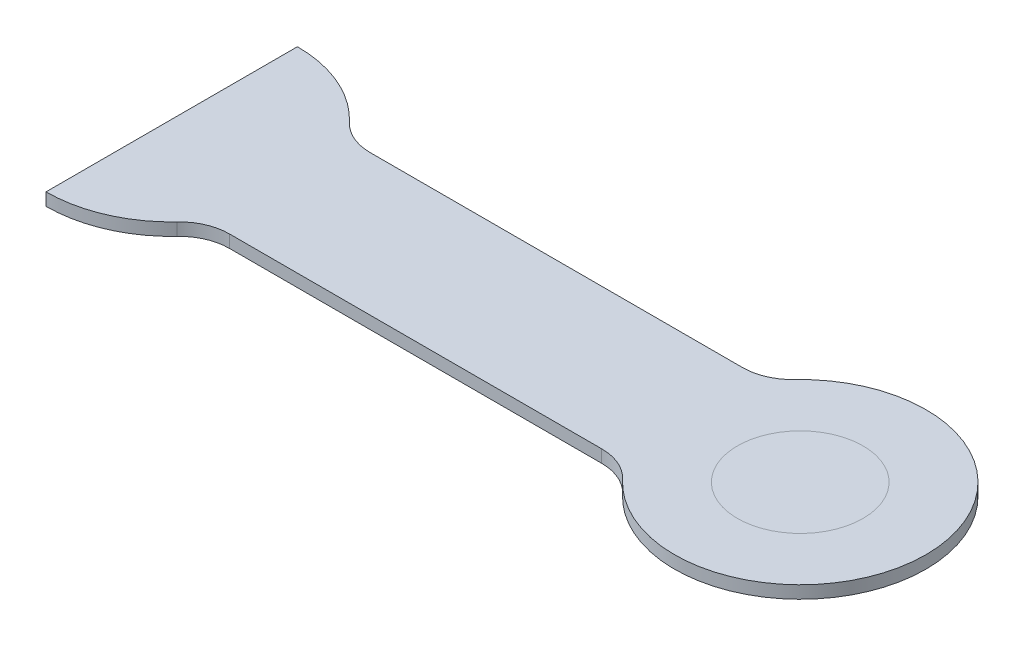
ISO-10303-21;
HEADER;
FILE_DESCRIPTION(('STEP AP214'),'2;1');
FILE_NAME('part.step','',(''),(''),'','','');
FILE_SCHEMA(('AUTOMOTIVE_DESIGN { 1 0 10303 214 1 1 1 1 }'));
ENDSEC;
DATA;
#1=APPLICATION_CONTEXT('core data for automotive mechanical design processes');
#2=APPLICATION_PROTOCOL_DEFINITION('international standard','automotive_design',2000,#1);
#3=PRODUCT_CONTEXT('',#1,'mechanical');
#4=PRODUCT('Part','Part','',(#3));
#5=PRODUCT_RELATED_PRODUCT_CATEGORY('part','',(#4));
#6=PRODUCT_DEFINITION_FORMATION('','',#4);
#7=PRODUCT_DEFINITION_CONTEXT('part definition',#1,'design');
#8=PRODUCT_DEFINITION('design','',#6,#7);
#9=PRODUCT_DEFINITION_SHAPE('','',#8);
#10=(LENGTH_UNIT() NAMED_UNIT(*) SI_UNIT(.MILLI.,.METRE.));
#11=(NAMED_UNIT(*) PLANE_ANGLE_UNIT() SI_UNIT($,.RADIAN.));
#12=(NAMED_UNIT(*) SI_UNIT($,.STERADIAN.) SOLID_ANGLE_UNIT());
#13=UNCERTAINTY_MEASURE_WITH_UNIT(LENGTH_MEASURE(1.E-05),#10,'distance_accuracy_value','');
#14=(GEOMETRIC_REPRESENTATION_CONTEXT(3) GLOBAL_UNCERTAINTY_ASSIGNED_CONTEXT((#13)) GLOBAL_UNIT_ASSIGNED_CONTEXT((#10,
#11,#12)) REPRESENTATION_CONTEXT('',''));
#15=CARTESIAN_POINT('',(0.,0.,0.));
#16=DIRECTION('',(0.,0.,1.));
#17=DIRECTION('',(1.,0.,0.));
#18=AXIS2_PLACEMENT_3D('',#15,#16,#17);
#19=CARTESIAN_POINT('',(0.,5.,50.));
#20=DIRECTION('',(0.,-1.,0.));
#21=DIRECTION('',(1.,0.,0.));
#22=AXIS2_PLACEMENT_3D('',#19,#20,#21);
#23=PLANE('',#22);
#24=DIRECTION('',(0.,0.,-1.));
#25=VECTOR('',#24,1.);
#26=CARTESIAN_POINT('',(-300.,4.99999999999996,50.));
#27=LINE('',#26,#25);
#28=CARTESIAN_POINT('',(-300.,4.99999999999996,50.));
#29=VERTEX_POINT('',#28);
#30=CARTESIAN_POINT('',(-300.,4.99999999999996,-50.));
#31=VERTEX_POINT('',#30);
#32=EDGE_CURVE('E115',#29,#31,#27,.T.);
#33=ORIENTED_EDGE('',*,*,#32,.F.);
#34=CARTESIAN_POINT('',(-300.,4.99999999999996,0.));
#35=DIRECTION('',(0.,1.,0.));
#36=DIRECTION('',(-1.,0.,0.));
#37=AXIS2_PLACEMENT_3D('',#34,#35,#36);
#38=CIRCLE('',#37,50.);
#39=CARTESIAN_POINT('',(-263.606459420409,4.99999999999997,34.2857142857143));
#40=VERTEX_POINT('',#39);
#41=EDGE_CURVE('E197',#29,#40,#38,.T.);
#42=ORIENTED_EDGE('',*,*,#41,.T.);
#43=CARTESIAN_POINT('',(-249.049043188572,4.99999999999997,48.));
#44=DIRECTION('',(0.,-1.,0.));
#45=DIRECTION('',(1.,0.,0.));
#46=AXIS2_PLACEMENT_3D('',#43,#44,#45);
#47=CIRCLE('',#46,20.);
#48=CARTESIAN_POINT('',(-249.049043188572,4.99999999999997,28.));
#49=VERTEX_POINT('',#48);
#50=EDGE_CURVE('E177',#40,#49,#47,.T.);
#51=ORIENTED_EDGE('',*,*,#50,.T.);
#52=DIRECTION('',(1.,0.,0.));
#53=VECTOR('',#52,1.);
#54=CARTESIAN_POINT('',(-91.424630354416,4.99999999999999,28.));
#55=LINE('',#54,#53);
#56=CARTESIAN_POINT('',(-100.950956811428,4.99999999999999,28.));
#57=VERTEX_POINT('',#56);
#58=EDGE_CURVE('E200',#49,#57,#55,.T.);
#59=ORIENTED_EDGE('',*,*,#58,.T.);
#60=CARTESIAN_POINT('',(-100.950956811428,4.99999999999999,48.));
#61=DIRECTION('',(0.,-1.,0.));
#62=DIRECTION('',(1.,0.,0.));
#63=AXIS2_PLACEMENT_3D('',#60,#61,#62);
#64=CIRCLE('',#63,20.);
#65=CARTESIAN_POINT('',(-86.3935405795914,4.99999999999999,34.2857142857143));
#66=VERTEX_POINT('',#65);
#67=EDGE_CURVE('E180',#57,#66,#64,.T.);
#68=ORIENTED_EDGE('',*,*,#67,.T.);
#69=CARTESIAN_POINT('',(-50.,4.99999999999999,0.));
#70=DIRECTION('',(0.,1.,0.));
#71=DIRECTION('',(-1.,0.,0.));
#72=AXIS2_PLACEMENT_3D('',#69,#70,#71);
#73=CIRCLE('',#72,50.);
#74=CARTESIAN_POINT('',(-86.3935405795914,4.99999999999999,-34.2857142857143));
#75=VERTEX_POINT('',#74);
#76=EDGE_CURVE('E186',#66,#75,#73,.T.);
#77=ORIENTED_EDGE('',*,*,#76,.T.);
#78=CARTESIAN_POINT('',(-100.950956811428,4.99999999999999,-48.));
#79=DIRECTION('',(0.,-1.,0.));
#80=DIRECTION('',(1.,0.,0.));
#81=AXIS2_PLACEMENT_3D('',#78,#79,#80);
#82=CIRCLE('',#81,20.);
#83=CARTESIAN_POINT('',(-100.950956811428,4.99999999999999,-28.));
#84=VERTEX_POINT('',#83);
#85=EDGE_CURVE('E41',#75,#84,#82,.T.);
#86=ORIENTED_EDGE('',*,*,#85,.T.);
#87=DIRECTION('',(-1.,0.,0.));
#88=VECTOR('',#87,1.);
#89=CARTESIAN_POINT('',(-91.424630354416,4.99999999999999,-28.));
#90=LINE('',#89,#88);
#91=CARTESIAN_POINT('',(-249.049043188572,4.99999999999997,-28.));
#92=VERTEX_POINT('',#91);
#93=EDGE_CURVE('E124',#84,#92,#90,.T.);
#94=ORIENTED_EDGE('',*,*,#93,.T.);
#95=CARTESIAN_POINT('',(-249.049043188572,4.99999999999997,-48.));
#96=DIRECTION('',(0.,-1.,0.));
#97=DIRECTION('',(1.,0.,0.));
#98=AXIS2_PLACEMENT_3D('',#95,#96,#97);
#99=CIRCLE('',#98,20.);
#100=CARTESIAN_POINT('',(-263.606459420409,4.99999999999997,-34.2857142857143));
#101=VERTEX_POINT('',#100);
#102=EDGE_CURVE('E119',#92,#101,#99,.T.);
#103=ORIENTED_EDGE('',*,*,#102,.T.);
#104=CARTESIAN_POINT('',(-300.,4.99999999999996,0.));
#105=DIRECTION('',(0.,1.,0.));
#106=DIRECTION('',(-1.,0.,0.));
#107=AXIS2_PLACEMENT_3D('',#104,#105,#106);
#108=CIRCLE('',#107,50.);
#109=EDGE_CURVE('E111',#101,#31,#108,.T.);
#110=ORIENTED_EDGE('',*,*,#109,.T.);
#111=EDGE_LOOP('',(#33,#42,#51,#59,#68,#77,#86,#94,#103,#110));
#112=FACE_BOUND('',#111,.T.);
#113=CARTESIAN_POINT('',(-50.,4.99999999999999,0.));
#114=DIRECTION('',(0.,-1.,0.));
#115=DIRECTION('',(1.,0.,0.));
#116=AXIS2_PLACEMENT_3D('',#113,#114,#115);
#117=CIRCLE('',#116,25.);
#118=CARTESIAN_POINT('',(-25.,5.,0.));
#119=VERTEX_POINT('',#118);
#120=EDGE_CURVE('E11',#119,#119,#117,.F.);
#121=ORIENTED_EDGE('',*,*,#120,.F.);
#122=EDGE_LOOP('',(#121));
#123=FACE_BOUND('',#122,.T.);
#124=ADVANCED_FACE('F32',(#112,#123),#23,.F.);
#125=CARTESIAN_POINT('',(-50.,4.99999999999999,0.));
#126=DIRECTION('',(0.,-1.,0.));
#127=DIRECTION('',(1.,0.,0.));
#128=AXIS2_PLACEMENT_3D('',#125,#126,#127);
#129=CYLINDRICAL_SURFACE('',#128,50.);
#130=ORIENTED_EDGE('',*,*,#76,.F.);
#131=DIRECTION('',(0.,-1.,0.));
#132=VECTOR('',#131,1.);
#133=CARTESIAN_POINT('',(-86.3935405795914,4.99999999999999,34.2857142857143));
#134=LINE('',#133,#132);
#135=CARTESIAN_POINT('',(-86.3935405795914,0.,34.2857142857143));
#136=VERTEX_POINT('',#135);
#137=EDGE_CURVE('E170',#66,#136,#134,.T.);
#138=ORIENTED_EDGE('',*,*,#137,.T.);
#139=CARTESIAN_POINT('',(-50.,0.,0.));
#140=DIRECTION('',(0.,-1.,0.));
#141=DIRECTION('',(1.,0.,0.));
#142=AXIS2_PLACEMENT_3D('',#139,#140,#141);
#143=CIRCLE('',#142,50.);
#144=CARTESIAN_POINT('',(-86.3935405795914,0.,-34.2857142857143));
#145=VERTEX_POINT('',#144);
#146=EDGE_CURVE('E145',#136,#145,#143,.F.);
#147=ORIENTED_EDGE('',*,*,#146,.T.);
#148=DIRECTION('',(0.,-1.,0.));
#149=VECTOR('',#148,1.);
#150=CARTESIAN_POINT('',(-86.3935405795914,4.99999999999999,-34.2857142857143));
#151=LINE('',#150,#149);
#152=EDGE_CURVE('E168',#145,#75,#151,.F.);
#153=ORIENTED_EDGE('',*,*,#152,.T.);
#154=EDGE_LOOP('',(#130,#138,#147,#153));
#155=FACE_BOUND('',#154,.T.);
#156=ADVANCED_FACE('F195',(#155),#129,.T.);
#157=CARTESIAN_POINT('',(-300.,4.99999999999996,0.));
#158=DIRECTION('',(0.,-1.,0.));
#159=DIRECTION('',(1.,0.,0.));
#160=AXIS2_PLACEMENT_3D('',#157,#158,#159);
#161=CYLINDRICAL_SURFACE('',#160,50.);
#162=CARTESIAN_POINT('',(-300.,0.,0.));
#163=DIRECTION('',(0.,-1.,0.));
#164=DIRECTION('',(1.,0.,0.));
#165=AXIS2_PLACEMENT_3D('',#162,#163,#164);
#166=CIRCLE('',#165,50.);
#167=CARTESIAN_POINT('',(-300.,0.,50.));
#168=VERTEX_POINT('',#167);
#169=CARTESIAN_POINT('',(-263.606459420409,0.,34.2857142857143));
#170=VERTEX_POINT('',#169);
#171=EDGE_CURVE('E141',#168,#170,#166,.F.);
#172=ORIENTED_EDGE('',*,*,#171,.T.);
#173=DIRECTION('',(0.,-1.,0.));
#174=VECTOR('',#173,1.);
#175=CARTESIAN_POINT('',(-263.606459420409,4.99999999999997,34.2857142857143));
#176=LINE('',#175,#174);
#177=EDGE_CURVE('E166',#170,#40,#176,.F.);
#178=ORIENTED_EDGE('',*,*,#177,.T.);
#179=ORIENTED_EDGE('',*,*,#41,.F.);
#180=DIRECTION('',(0.,1.,0.));
#181=VECTOR('',#180,1.);
#182=CARTESIAN_POINT('',(-300.,0.,50.));
#183=LINE('',#182,#181);
#184=EDGE_CURVE('E132',#168,#29,#183,.T.);
#185=ORIENTED_EDGE('',*,*,#184,.F.);
#186=EDGE_LOOP('',(#172,#178,#179,#185));
#187=FACE_BOUND('',#186,.T.);
#188=ADVANCED_FACE('F215',(#187),#161,.T.);
#189=CARTESIAN_POINT('',(-91.424630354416,4.99999999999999,28.));
#190=DIRECTION('',(0.,0.,-1.));
#191=DIRECTION('',(-1.,0.,0.));
#192=AXIS2_PLACEMENT_3D('',#189,#190,#191);
#193=PLANE('',#192);
#194=ORIENTED_EDGE('',*,*,#58,.F.);
#195=DIRECTION('',(0.,1.,0.));
#196=VECTOR('',#195,1.);
#197=CARTESIAN_POINT('',(-249.049043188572,0.,28.));
#198=LINE('',#197,#196);
#199=CARTESIAN_POINT('',(-249.049043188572,0.,28.));
#200=VERTEX_POINT('',#199);
#201=EDGE_CURVE('E163',#49,#200,#198,.F.);
#202=ORIENTED_EDGE('',*,*,#201,.T.);
#203=DIRECTION('',(1.,0.,0.));
#204=VECTOR('',#203,1.);
#205=CARTESIAN_POINT('',(0.,0.,28.));
#206=LINE('',#205,#204);
#207=CARTESIAN_POINT('',(-100.950956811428,0.,28.));
#208=VERTEX_POINT('',#207);
#209=EDGE_CURVE('E151',#200,#208,#206,.T.);
#210=ORIENTED_EDGE('',*,*,#209,.T.);
#211=DIRECTION('',(0.,1.,0.));
#212=VECTOR('',#211,1.);
#213=CARTESIAN_POINT('',(-100.950956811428,4.99999999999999,28.));
#214=LINE('',#213,#212);
#215=EDGE_CURVE('E161',#208,#57,#214,.T.);
#216=ORIENTED_EDGE('',*,*,#215,.T.);
#217=EDGE_LOOP('',(#194,#202,#210,#216));
#218=FACE_BOUND('',#217,.T.);
#219=ADVANCED_FACE('F213',(#218),#193,.F.);
#220=CARTESIAN_POINT('',(-91.424630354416,4.99999999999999,-28.));
#221=DIRECTION('',(0.,0.,1.));
#222=DIRECTION('',(1.,0.,0.));
#223=AXIS2_PLACEMENT_3D('',#220,#221,#222);
#224=PLANE('',#223);
#225=DIRECTION('',(-1.,0.,0.));
#226=VECTOR('',#225,1.);
#227=CARTESIAN_POINT('',(0.,0.,-28.));
#228=LINE('',#227,#226);
#229=CARTESIAN_POINT('',(-100.950956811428,0.,-28.));
#230=VERTEX_POINT('',#229);
#231=CARTESIAN_POINT('',(-249.049043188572,0.,-28.));
#232=VERTEX_POINT('',#231);
#233=EDGE_CURVE('E134',#230,#232,#228,.T.);
#234=ORIENTED_EDGE('',*,*,#233,.T.);
#235=DIRECTION('',(0.,1.,0.));
#236=VECTOR('',#235,1.);
#237=CARTESIAN_POINT('',(-249.049043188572,4.99999999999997,-28.));
#238=LINE('',#237,#236);
#239=EDGE_CURVE('E159',#232,#92,#238,.T.);
#240=ORIENTED_EDGE('',*,*,#239,.T.);
#241=ORIENTED_EDGE('',*,*,#93,.F.);
#242=DIRECTION('',(0.,1.,0.));
#243=VECTOR('',#242,1.);
#244=CARTESIAN_POINT('',(-100.950956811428,0.,-28.));
#245=LINE('',#244,#243);
#246=EDGE_CURVE('E156',#84,#230,#245,.F.);
#247=ORIENTED_EDGE('',*,*,#246,.T.);
#248=EDGE_LOOP('',(#234,#240,#241,#247));
#249=FACE_BOUND('',#248,.T.);
#250=ADVANCED_FACE('F191',(#249),#224,.F.);
#251=CARTESIAN_POINT('',(-300.,4.99999999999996,0.));
#252=DIRECTION('',(0.,-1.,0.));
#253=DIRECTION('',(1.,0.,0.));
#254=AXIS2_PLACEMENT_3D('',#251,#252,#253);
#255=CYLINDRICAL_SURFACE('',#254,50.);
#256=ORIENTED_EDGE('',*,*,#109,.F.);
#257=DIRECTION('',(0.,-1.,0.));
#258=VECTOR('',#257,1.);
#259=CARTESIAN_POINT('',(-263.606459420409,4.99999999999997,-34.2857142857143));
#260=LINE('',#259,#258);
#261=CARTESIAN_POINT('',(-263.606459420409,0.,-34.2857142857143));
#262=VERTEX_POINT('',#261);
#263=EDGE_CURVE('E154',#101,#262,#260,.T.);
#264=ORIENTED_EDGE('',*,*,#263,.T.);
#265=CARTESIAN_POINT('',(-300.,0.,0.));
#266=DIRECTION('',(0.,-1.,0.));
#267=DIRECTION('',(1.,0.,0.));
#268=AXIS2_PLACEMENT_3D('',#265,#266,#267);
#269=CIRCLE('',#268,50.);
#270=CARTESIAN_POINT('',(-300.,0.,-50.));
#271=VERTEX_POINT('',#270);
#272=EDGE_CURVE('E139',#262,#271,#269,.F.);
#273=ORIENTED_EDGE('',*,*,#272,.T.);
#274=DIRECTION('',(0.,1.,0.));
#275=VECTOR('',#274,1.);
#276=CARTESIAN_POINT('',(-300.,0.,-50.));
#277=LINE('',#276,#275);
#278=EDGE_CURVE('E130',#271,#31,#277,.T.);
#279=ORIENTED_EDGE('',*,*,#278,.T.);
#280=EDGE_LOOP('',(#256,#264,#273,#279));
#281=FACE_BOUND('',#280,.T.);
#282=ADVANCED_FACE('F137',(#281),#255,.T.);
#283=ORIENTED_EDGE('',*,*,#120,.T.);
#284=EDGE_LOOP('',(#283));
#285=FACE_BOUND('',#284,.T.);
#286=ADVANCED_FACE('F218',(#285),#23,.F.);
#287=CARTESIAN_POINT('',(-300.,0.,50.));
#288=DIRECTION('',(-1.,0.,0.));
#289=DIRECTION('',(0.,0.,1.));
#290=AXIS2_PLACEMENT_3D('',#287,#288,#289);
#291=PLANE('',#290);
#292=ORIENTED_EDGE('',*,*,#278,.F.);
#293=DIRECTION('',(0.,0.,-1.));
#294=VECTOR('',#293,1.);
#295=CARTESIAN_POINT('',(-300.,0.,50.));
#296=LINE('',#295,#294);
#297=EDGE_CURVE('E135',#168,#271,#296,.T.);
#298=ORIENTED_EDGE('',*,*,#297,.F.);
#299=ORIENTED_EDGE('',*,*,#184,.T.);
#300=ORIENTED_EDGE('',*,*,#32,.T.);
#301=EDGE_LOOP('',(#292,#298,#299,#300));
#302=FACE_BOUND('',#301,.T.);
#303=ADVANCED_FACE('F128',(#302),#291,.T.);
#304=CARTESIAN_POINT('',(0.,0.,50.));
#305=DIRECTION('',(0.,-1.,0.));
#306=DIRECTION('',(1.,0.,0.));
#307=AXIS2_PLACEMENT_3D('',#304,#305,#306);
#308=PLANE('',#307);
#309=ORIENTED_EDGE('',*,*,#171,.F.);
#310=ORIENTED_EDGE('',*,*,#297,.T.);
#311=ORIENTED_EDGE('',*,*,#272,.F.);
#312=CARTESIAN_POINT('',(-249.049043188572,0.,-48.));
#313=DIRECTION('',(0.,-1.,0.));
#314=DIRECTION('',(1.,0.,0.));
#315=AXIS2_PLACEMENT_3D('',#312,#313,#314);
#316=CIRCLE('',#315,20.);
#317=EDGE_CURVE('E172',#262,#232,#316,.F.);
#318=ORIENTED_EDGE('',*,*,#317,.T.);
#319=ORIENTED_EDGE('',*,*,#233,.F.);
#320=CARTESIAN_POINT('',(-100.950956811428,0.,-48.));
#321=DIRECTION('',(0.,-1.,0.));
#322=DIRECTION('',(1.,0.,0.));
#323=AXIS2_PLACEMENT_3D('',#320,#321,#322);
#324=CIRCLE('',#323,20.);
#325=EDGE_CURVE('E48',#230,#145,#324,.F.);
#326=ORIENTED_EDGE('',*,*,#325,.T.);
#327=ORIENTED_EDGE('',*,*,#146,.F.);
#328=CARTESIAN_POINT('',(-100.950956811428,0.,48.));
#329=DIRECTION('',(0.,-1.,0.));
#330=DIRECTION('',(1.,0.,0.));
#331=AXIS2_PLACEMENT_3D('',#328,#329,#330);
#332=CIRCLE('',#331,20.);
#333=EDGE_CURVE('E56',#136,#208,#332,.F.);
#334=ORIENTED_EDGE('',*,*,#333,.T.);
#335=ORIENTED_EDGE('',*,*,#209,.F.);
#336=CARTESIAN_POINT('',(-249.049043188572,0.,48.));
#337=DIRECTION('',(0.,-1.,0.));
#338=DIRECTION('',(1.,0.,0.));
#339=AXIS2_PLACEMENT_3D('',#336,#337,#338);
#340=CIRCLE('',#339,20.);
#341=EDGE_CURVE('E175',#200,#170,#340,.F.);
#342=ORIENTED_EDGE('',*,*,#341,.T.);
#343=EDGE_LOOP('',(#309,#310,#311,#318,#319,#326,#327,#334,#335,#342));
#344=FACE_BOUND('',#343,.T.);
#345=ADVANCED_FACE('F214',(#344),#308,.T.);
#346=CARTESIAN_POINT('',(-249.049043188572,4.99999999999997,-48.));
#347=DIRECTION('',(0.,-1.,0.));
#348=DIRECTION('',(1.,0.,0.));
#349=AXIS2_PLACEMENT_3D('',#346,#347,#348);
#350=CYLINDRICAL_SURFACE('',#349,20.);
#351=ORIENTED_EDGE('',*,*,#102,.F.);
#352=ORIENTED_EDGE('',*,*,#239,.F.);
#353=ORIENTED_EDGE('',*,*,#317,.F.);
#354=ORIENTED_EDGE('',*,*,#263,.F.);
#355=EDGE_LOOP('',(#351,#352,#353,#354));
#356=FACE_BOUND('',#355,.T.);
#357=ADVANCED_FACE('F234',(#356),#350,.F.);
#358=CARTESIAN_POINT('',(-249.049043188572,4.99999999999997,48.));
#359=DIRECTION('',(0.,-1.,0.));
#360=DIRECTION('',(1.,0.,0.));
#361=AXIS2_PLACEMENT_3D('',#358,#359,#360);
#362=CYLINDRICAL_SURFACE('',#361,20.);
#363=ORIENTED_EDGE('',*,*,#50,.F.);
#364=ORIENTED_EDGE('',*,*,#177,.F.);
#365=ORIENTED_EDGE('',*,*,#341,.F.);
#366=ORIENTED_EDGE('',*,*,#201,.F.);
#367=EDGE_LOOP('',(#363,#364,#365,#366));
#368=FACE_BOUND('',#367,.T.);
#369=ADVANCED_FACE('F210',(#368),#362,.F.);
#370=CARTESIAN_POINT('',(-100.950956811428,4.99999999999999,48.));
#371=DIRECTION('',(0.,-1.,0.));
#372=DIRECTION('',(1.,0.,0.));
#373=AXIS2_PLACEMENT_3D('',#370,#371,#372);
#374=CYLINDRICAL_SURFACE('',#373,20.);
#375=ORIENTED_EDGE('',*,*,#67,.F.);
#376=ORIENTED_EDGE('',*,*,#215,.F.);
#377=ORIENTED_EDGE('',*,*,#333,.F.);
#378=ORIENTED_EDGE('',*,*,#137,.F.);
#379=EDGE_LOOP('',(#375,#376,#377,#378));
#380=FACE_BOUND('',#379,.T.);
#381=ADVANCED_FACE('F239',(#380),#374,.F.);
#382=CARTESIAN_POINT('',(-100.950956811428,4.99999999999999,-48.));
#383=DIRECTION('',(0.,-1.,0.));
#384=DIRECTION('',(1.,0.,0.));
#385=AXIS2_PLACEMENT_3D('',#382,#383,#384);
#386=CYLINDRICAL_SURFACE('',#385,20.);
#387=ORIENTED_EDGE('',*,*,#85,.F.);
#388=ORIENTED_EDGE('',*,*,#152,.F.);
#389=ORIENTED_EDGE('',*,*,#325,.F.);
#390=ORIENTED_EDGE('',*,*,#246,.F.);
#391=EDGE_LOOP('',(#387,#388,#389,#390));
#392=FACE_BOUND('',#391,.T.);
#393=ADVANCED_FACE('F34',(#392),#386,.F.);
#394=CLOSED_SHELL('',(#124,#156,#188,#219,#250,#282,#286,#303,#345,#357,#369,#381,#393));
#395=MANIFOLD_SOLID_BREP('B2',#394);
#396=ADVANCED_BREP_SHAPE_REPRESENTATION('',(#18,#395),#14);
#397=SHAPE_DEFINITION_REPRESENTATION(#9,#396);
ENDSEC;
END-ISO-10303-21;
